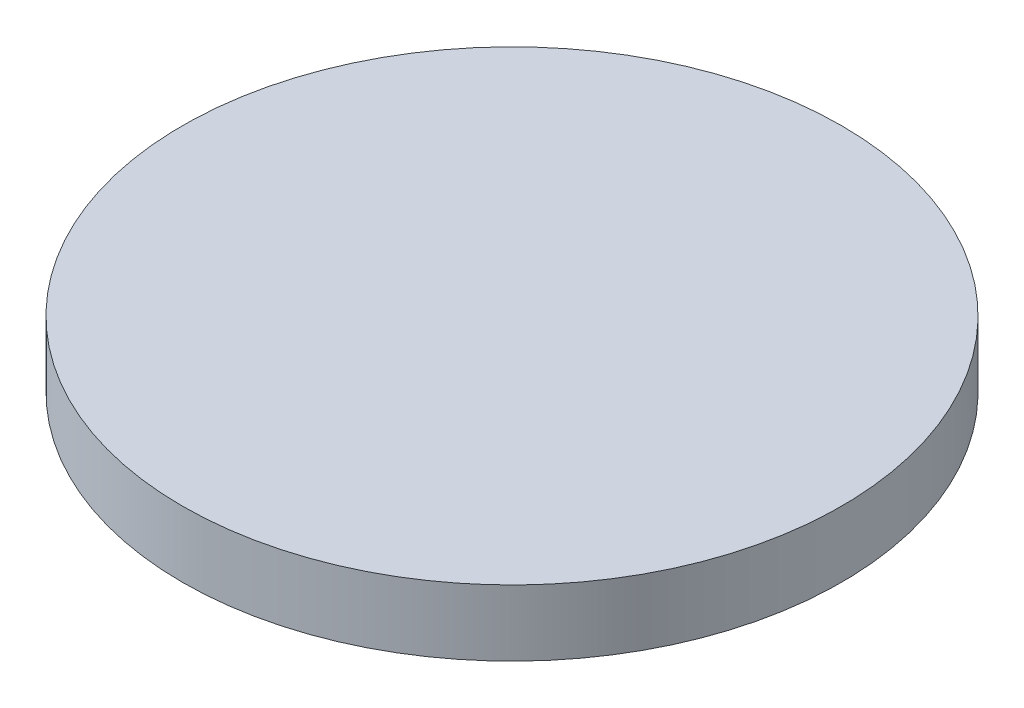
ISO-10303-21;
HEADER;
FILE_DESCRIPTION(('STEP AP214'),'2;1');
FILE_NAME('part.step','',(''),(''),'','','');
FILE_SCHEMA(('AUTOMOTIVE_DESIGN { 1 0 10303 214 1 1 1 1 }'));
ENDSEC;
DATA;
#1=APPLICATION_CONTEXT('core data for automotive mechanical design processes');
#2=APPLICATION_PROTOCOL_DEFINITION('international standard','automotive_design',2000,#1);
#3=PRODUCT_CONTEXT('',#1,'mechanical');
#4=PRODUCT('Part','Part','',(#3));
#5=PRODUCT_RELATED_PRODUCT_CATEGORY('part','',(#4));
#6=PRODUCT_DEFINITION_FORMATION('','',#4);
#7=PRODUCT_DEFINITION_CONTEXT('part definition',#1,'design');
#8=PRODUCT_DEFINITION('design','',#6,#7);
#9=PRODUCT_DEFINITION_SHAPE('','',#8);
#10=(LENGTH_UNIT() NAMED_UNIT(*) SI_UNIT(.MILLI.,.METRE.));
#11=(NAMED_UNIT(*) PLANE_ANGLE_UNIT() SI_UNIT($,.RADIAN.));
#12=(NAMED_UNIT(*) SI_UNIT($,.STERADIAN.) SOLID_ANGLE_UNIT());
#13=UNCERTAINTY_MEASURE_WITH_UNIT(LENGTH_MEASURE(1.E-05),#10,'distance_accuracy_value','');
#14=(GEOMETRIC_REPRESENTATION_CONTEXT(3) GLOBAL_UNCERTAINTY_ASSIGNED_CONTEXT((#13)) GLOBAL_UNIT_ASSIGNED_CONTEXT((#10,
#11,#12)) REPRESENTATION_CONTEXT('',''));
#15=CARTESIAN_POINT('',(0.,0.,0.));
#16=DIRECTION('',(0.,0.,1.));
#17=DIRECTION('',(1.,0.,0.));
#18=AXIS2_PLACEMENT_3D('',#15,#16,#17);
#19=CARTESIAN_POINT('',(625.914623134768,97.3452440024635,0.));
#20=DIRECTION('',(0.,1.,0.));
#21=DIRECTION('',(0.,0.,1.));
#22=AXIS2_PLACEMENT_3D('',#19,#20,#21);
#23=PLANE('',#22);
#24=CARTESIAN_POINT('',(625.914623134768,97.3452440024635,0.));
#25=DIRECTION('',(0.,-1.,0.));
#26=DIRECTION('',(0.,0.,-1.));
#27=AXIS2_PLACEMENT_3D('',#24,#25,#26);
#28=CIRCLE('',#27,9.906);
#29=CARTESIAN_POINT('',(625.914623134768,97.3452440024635,-9.906));
#30=VERTEX_POINT('',#29);
#31=EDGE_CURVE('E17',#30,#30,#28,.T.);
#32=ORIENTED_EDGE('',*,*,#31,.F.);
#33=EDGE_LOOP('',(#32));
#34=FACE_BOUND('',#33,.T.);
#35=ADVANCED_FACE('F14',(#34),#23,.T.);
#36=CARTESIAN_POINT('',(625.914623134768,96.3533740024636,0.));
#37=DIRECTION('',(0.,-1.,0.));
#38=DIRECTION('',(0.,0.,-1.));
#39=AXIS2_PLACEMENT_3D('',#36,#37,#38);
#40=CYLINDRICAL_SURFACE('',#39,9.906);
#41=CARTESIAN_POINT('',(625.914623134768,95.3615040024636,0.));
#42=DIRECTION('',(0.,-1.,0.));
#43=DIRECTION('',(0.,0.,-1.));
#44=AXIS2_PLACEMENT_3D('',#41,#42,#43);
#45=CIRCLE('',#44,9.906);
#46=CARTESIAN_POINT('',(625.914623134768,95.3615040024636,-9.906));
#47=VERTEX_POINT('',#46);
#48=EDGE_CURVE('E10',#47,#47,#45,.T.);
#49=ORIENTED_EDGE('',*,*,#48,.F.);
#50=EDGE_LOOP('',(#49));
#51=FACE_BOUND('',#50,.T.);
#52=ORIENTED_EDGE('',*,*,#31,.T.);
#53=EDGE_LOOP('',(#52));
#54=FACE_BOUND('',#53,.T.);
#55=ADVANCED_FACE('F26',(#51,#54),#40,.T.);
#56=CARTESIAN_POINT('',(625.914623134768,95.3615040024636,0.));
#57=DIRECTION('',(0.,-1.,0.));
#58=DIRECTION('',(0.,0.,-1.));
#59=AXIS2_PLACEMENT_3D('',#56,#57,#58);
#60=PLANE('',#59);
#61=ORIENTED_EDGE('',*,*,#48,.T.);
#62=EDGE_LOOP('',(#61));
#63=FACE_BOUND('',#62,.T.);
#64=ADVANCED_FACE('F33',(#63),#60,.T.);
#65=CLOSED_SHELL('',(#35,#55,#64));
#66=MANIFOLD_SOLID_BREP('B1',#65);
#67=ADVANCED_BREP_SHAPE_REPRESENTATION('',(#18,#66),#14);
#68=SHAPE_DEFINITION_REPRESENTATION(#9,#67);
ENDSEC;
END-ISO-10303-21;
